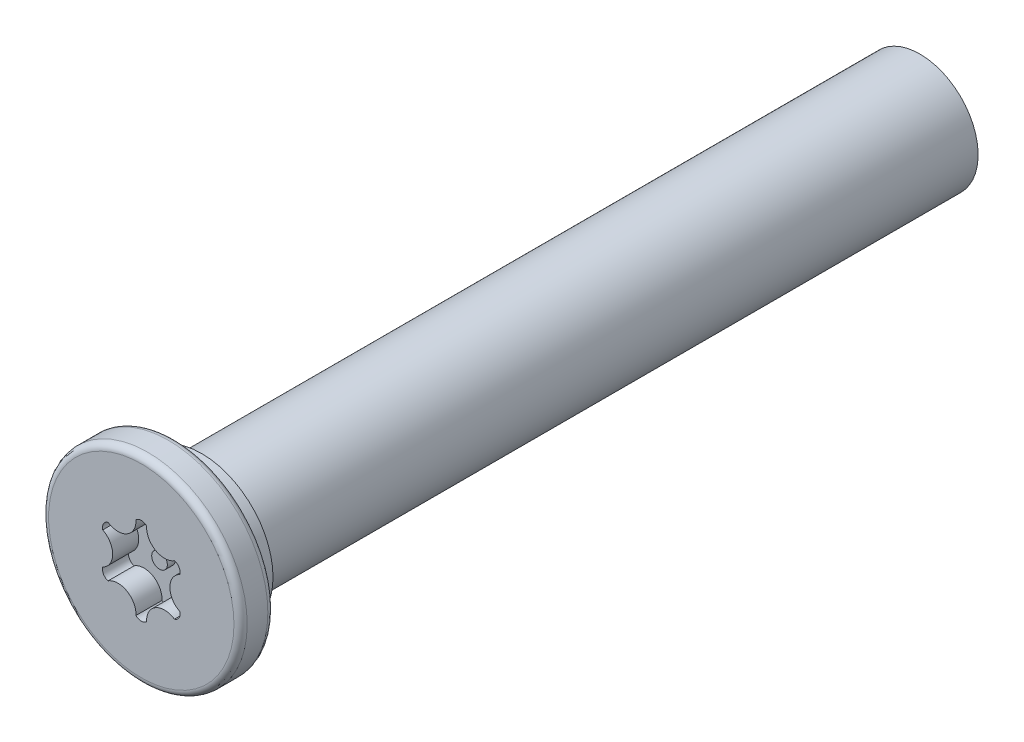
ISO-10303-21;
HEADER;
FILE_DESCRIPTION(('STEP AP214'),'2;1');
FILE_NAME('part.step','',(''),(''),'','','');
FILE_SCHEMA(('AUTOMOTIVE_DESIGN { 1 0 10303 214 1 1 1 1 }'));
ENDSEC;
DATA;
#1=APPLICATION_CONTEXT('core data for automotive mechanical design processes');
#2=APPLICATION_PROTOCOL_DEFINITION('international standard','automotive_design',2000,#1);
#3=PRODUCT_CONTEXT('',#1,'mechanical');
#4=PRODUCT('Part','Part','',(#3));
#5=PRODUCT_RELATED_PRODUCT_CATEGORY('part','',(#4));
#6=PRODUCT_DEFINITION_FORMATION('','',#4);
#7=PRODUCT_DEFINITION_CONTEXT('part definition',#1,'design');
#8=PRODUCT_DEFINITION('design','',#6,#7);
#9=PRODUCT_DEFINITION_SHAPE('','',#8);
#10=(LENGTH_UNIT() NAMED_UNIT(*) SI_UNIT(.MILLI.,.METRE.));
#11=(NAMED_UNIT(*) PLANE_ANGLE_UNIT() SI_UNIT($,.RADIAN.));
#12=(NAMED_UNIT(*) SI_UNIT($,.STERADIAN.) SOLID_ANGLE_UNIT());
#13=UNCERTAINTY_MEASURE_WITH_UNIT(LENGTH_MEASURE(1.E-05),#10,'distance_accuracy_value','');
#14=(GEOMETRIC_REPRESENTATION_CONTEXT(3) GLOBAL_UNCERTAINTY_ASSIGNED_CONTEXT((#13)) GLOBAL_UNIT_ASSIGNED_CONTEXT((#10,
#11,#12)) REPRESENTATION_CONTEXT('',''));
#15=CARTESIAN_POINT('',(0.,0.,0.));
#16=DIRECTION('',(0.,0.,1.));
#17=DIRECTION('',(1.,0.,0.));
#18=AXIS2_PLACEMENT_3D('',#15,#16,#17);
#19=CARTESIAN_POINT('',(0.,0.,0.));
#20=DIRECTION('',(0.,0.,1.));
#21=DIRECTION('',(1.,0.,0.));
#22=AXIS2_PLACEMENT_3D('',#19,#20,#21);
#23=PLANE('',#22);
#24=CARTESIAN_POINT('',(0.,0.,0.));
#25=DIRECTION('',(0.,0.,1.));
#26=DIRECTION('',(1.,0.,0.));
#27=AXIS2_PLACEMENT_3D('',#24,#25,#26);
#28=CIRCLE('',#27,3.55599999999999);
#29=CARTESIAN_POINT('',(3.55599999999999,0.,0.));
#30=VERTEX_POINT('',#29);
#31=EDGE_CURVE('E54',#30,#30,#28,.T.);
#32=ORIENTED_EDGE('',*,*,#31,.T.);
#33=EDGE_LOOP('',(#32));
#34=FACE_BOUND('',#33,.T.);
#35=CARTESIAN_POINT('',(0.893828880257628,1.54815703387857,0.));
#36=DIRECTION('',(0.,0.,1.));
#37=DIRECTION('',(1.,0.,0.));
#38=AXIS2_PLACEMENT_3D('',#35,#36,#37);
#39=CIRCLE('',#38,0.69);
#40=CARTESIAN_POINT('',(0.205060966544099,1.58937306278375,0.));
#41=VERTEX_POINT('',#40);
#42=CARTESIAN_POINT('',(1.27390696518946,0.972274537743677,0.));
#43=VERTEX_POINT('',#42);
#44=EDGE_CURVE('E181',#41,#43,#39,.T.);
#45=ORIENTED_EDGE('',*,*,#44,.T.);
#46=CARTESIAN_POINT('',(1.19884944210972,0.692156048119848,0.));
#47=DIRECTION('',(0.,0.,1.));
#48=DIRECTION('',(1.,0.,0.));
#49=AXIS2_PLACEMENT_3D('',#46,#47,#48);
#50=CIRCLE('',#49,0.29);
#51=CARTESIAN_POINT('',(1.47896793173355,0.617098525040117,0.));
#52=VERTEX_POINT('',#51);
#53=EDGE_CURVE('E61',#43,#52,#50,.F.);
#54=ORIENTED_EDGE('',*,*,#53,.T.);
#55=CARTESIAN_POINT('',(1.78765776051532,0.,0.));
#56=DIRECTION('',(0.,0.,1.));
#57=DIRECTION('',(1.,0.,0.));
#58=AXIS2_PLACEMENT_3D('',#55,#56,#57);
#59=CIRCLE('',#58,0.69);
#60=CARTESIAN_POINT('',(1.47896793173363,-0.617098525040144,0.));
#61=VERTEX_POINT('',#60);
#62=EDGE_CURVE('E111',#52,#61,#59,.T.);
#63=ORIENTED_EDGE('',*,*,#62,.T.);
#64=CARTESIAN_POINT('',(1.1988494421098,-0.692156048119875,0.));
#65=DIRECTION('',(0.,0.,1.));
#66=DIRECTION('',(1.,0.,0.));
#67=AXIS2_PLACEMENT_3D('',#64,#65,#66);
#68=CIRCLE('',#67,0.29);
#69=CARTESIAN_POINT('',(1.27390696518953,-0.972274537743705,0.));
#70=VERTEX_POINT('',#69);
#71=EDGE_CURVE('E216',#61,#70,#68,.F.);
#72=ORIENTED_EDGE('',*,*,#71,.T.);
#73=CARTESIAN_POINT('',(0.893828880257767,-1.54815703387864,0.));
#74=DIRECTION('',(0.,0.,1.));
#75=DIRECTION('',(1.,0.,0.));
#76=AXIS2_PLACEMENT_3D('',#73,#74,#75);
#77=CIRCLE('',#76,0.69);
#78=CARTESIAN_POINT('',(0.205060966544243,-1.5893730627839,0.));
#79=VERTEX_POINT('',#78);
#80=EDGE_CURVE('E160',#70,#79,#77,.T.);
#81=ORIENTED_EDGE('',*,*,#80,.T.);
#82=CARTESIAN_POINT('',(1.43067375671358E-13,-1.3843120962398,0.));
#83=DIRECTION('',(0.,0.,1.));
#84=DIRECTION('',(1.,0.,0.));
#85=AXIS2_PLACEMENT_3D('',#82,#83,#84);
#86=CIRCLE('',#85,0.29);
#87=CARTESIAN_POINT('',(-0.205060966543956,-1.5893730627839,0.));
#88=VERTEX_POINT('',#87);
#89=EDGE_CURVE('E210',#79,#88,#86,.F.);
#90=ORIENTED_EDGE('',*,*,#89,.T.);
#91=CARTESIAN_POINT('',(-0.893828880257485,-1.54815703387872,0.));
#92=DIRECTION('',(0.,0.,1.));
#93=DIRECTION('',(1.,0.,0.));
#94=AXIS2_PLACEMENT_3D('',#91,#92,#93);
#95=CIRCLE('',#94,0.69);
#96=CARTESIAN_POINT('',(-1.27390696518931,-0.97227453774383,0.));
#97=VERTEX_POINT('',#96);
#98=EDGE_CURVE('E206',#88,#97,#95,.T.);
#99=ORIENTED_EDGE('',*,*,#98,.T.);
#100=CARTESIAN_POINT('',(-1.19884944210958,-0.69215604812,0.));
#101=DIRECTION('',(0.,0.,1.));
#102=DIRECTION('',(1.,0.,0.));
#103=AXIS2_PLACEMENT_3D('',#100,#101,#102);
#104=CIRCLE('',#103,0.29);
#105=CARTESIAN_POINT('',(-1.47896793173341,-0.617098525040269,0.));
#106=VERTEX_POINT('',#105);
#107=EDGE_CURVE('E202',#97,#106,#104,.F.);
#108=ORIENTED_EDGE('',*,*,#107,.T.);
#109=CARTESIAN_POINT('',(-1.78765776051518,-1.56674837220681E-13,0.));
#110=DIRECTION('',(0.,0.,1.));
#111=DIRECTION('',(1.,0.,0.));
#112=AXIS2_PLACEMENT_3D('',#109,#110,#111);
#113=CIRCLE('',#112,0.69);
#114=CARTESIAN_POINT('',(-1.47896793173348,0.617098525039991,0.));
#115=VERTEX_POINT('',#114);
#116=EDGE_CURVE('E198',#106,#115,#113,.T.);
#117=ORIENTED_EDGE('',*,*,#116,.T.);
#118=CARTESIAN_POINT('',(-1.19884944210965,0.692156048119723,0.));
#119=DIRECTION('',(0.,0.,1.));
#120=DIRECTION('',(1.,0.,0.));
#121=AXIS2_PLACEMENT_3D('',#118,#119,#120);
#122=CIRCLE('',#121,0.29);
#123=CARTESIAN_POINT('',(-1.27390696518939,0.972274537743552,0.));
#124=VERTEX_POINT('',#123);
#125=EDGE_CURVE('E194',#115,#124,#122,.F.);
#126=ORIENTED_EDGE('',*,*,#125,.T.);
#127=CARTESIAN_POINT('',(-0.893828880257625,1.54815703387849,0.));
#128=DIRECTION('',(0.,0.,1.));
#129=DIRECTION('',(1.,0.,0.));
#130=AXIS2_PLACEMENT_3D('',#127,#128,#129);
#131=CIRCLE('',#130,0.690000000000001);
#132=CARTESIAN_POINT('',(-0.205060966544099,1.58937306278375,0.));
#133=VERTEX_POINT('',#132);
#134=EDGE_CURVE('E190',#124,#133,#131,.T.);
#135=ORIENTED_EDGE('',*,*,#134,.T.);
#136=CARTESIAN_POINT('',(0.,1.38431209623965,0.));
#137=DIRECTION('',(0.,0.,1.));
#138=DIRECTION('',(1.,0.,0.));
#139=AXIS2_PLACEMENT_3D('',#136,#137,#138);
#140=CIRCLE('',#139,0.29);
#141=EDGE_CURVE('E186',#133,#41,#140,.F.);
#142=ORIENTED_EDGE('',*,*,#141,.T.);
#143=EDGE_LOOP('',(#45,#54,#63,#72,#81,#90,#99,#108,#117,#126,#135,#142));
#144=FACE_BOUND('',#143,.T.);
#145=ADVANCED_FACE('F45',(#34,#144),#23,.T.);
#146=CARTESIAN_POINT('',(0.,0.,-1.3));
#147=DIRECTION('',(0.,0.,1.));
#148=DIRECTION('',(1.,0.,0.));
#149=AXIS2_PLACEMENT_3D('',#146,#147,#148);
#150=PLANE('',#149);
#151=CARTESIAN_POINT('',(0.,0.,-1.3));
#152=DIRECTION('',(0.,0.,1.));
#153=DIRECTION('',(1.,0.,0.));
#154=AXIS2_PLACEMENT_3D('',#151,#152,#153);
#155=CIRCLE('',#154,2.738000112);
#156=CARTESIAN_POINT('',(2.738000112,0.,-1.3));
#157=VERTEX_POINT('',#156);
#158=EDGE_CURVE('E11',#157,#157,#155,.F.);
#159=ORIENTED_EDGE('',*,*,#158,.F.);
#160=EDGE_LOOP('',(#159));
#161=FACE_BOUND('',#160,.T.);
#162=CARTESIAN_POINT('',(0.,0.,-1.3));
#163=DIRECTION('',(0.,0.,1.));
#164=DIRECTION('',(1.,0.,0.));
#165=AXIS2_PLACEMENT_3D('',#162,#163,#164);
#166=CIRCLE('',#165,3.55599999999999);
#167=CARTESIAN_POINT('',(3.55599999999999,0.,-1.3));
#168=VERTEX_POINT('',#167);
#169=EDGE_CURVE('E260',#168,#168,#166,.F.);
#170=ORIENTED_EDGE('',*,*,#169,.T.);
#171=EDGE_LOOP('',(#170));
#172=FACE_BOUND('',#171,.T.);
#173=ADVANCED_FACE('F283',(#161,#172),#150,.F.);
#174=CARTESIAN_POINT('',(0.,0.,-1.3));
#175=DIRECTION('',(0.,0.,1.));
#176=DIRECTION('',(1.,0.,0.));
#177=AXIS2_PLACEMENT_3D('',#174,#175,#176);
#178=CYLINDRICAL_SURFACE('',#177,3.80999999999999);
#179=CARTESIAN_POINT('',(0.,0.,-1.046));
#180=DIRECTION('',(0.,0.,1.));
#181=DIRECTION('',(1.,0.,0.));
#182=AXIS2_PLACEMENT_3D('',#179,#180,#181);
#183=CIRCLE('',#182,3.80999999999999);
#184=CARTESIAN_POINT('',(3.80999999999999,0.,-1.046));
#185=VERTEX_POINT('',#184);
#186=EDGE_CURVE('E256',#185,#185,#183,.T.);
#187=ORIENTED_EDGE('',*,*,#186,.T.);
#188=EDGE_LOOP('',(#187));
#189=FACE_BOUND('',#188,.T.);
#190=CARTESIAN_POINT('',(0.,0.,-0.254));
#191=DIRECTION('',(0.,0.,1.));
#192=DIRECTION('',(1.,0.,0.));
#193=AXIS2_PLACEMENT_3D('',#190,#191,#192);
#194=CIRCLE('',#193,3.80999999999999);
#195=CARTESIAN_POINT('',(3.80999999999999,0.,-0.254));
#196=VERTEX_POINT('',#195);
#197=EDGE_CURVE('E225',#196,#196,#194,.F.);
#198=ORIENTED_EDGE('',*,*,#197,.T.);
#199=EDGE_LOOP('',(#198));
#200=FACE_BOUND('',#199,.T.);
#201=ADVANCED_FACE('F289',(#189,#200),#178,.T.);
#202=CARTESIAN_POINT('',(1.19884944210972,0.692156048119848,-1.));
#203=DIRECTION('',(0.,0.,1.));
#204=DIRECTION('',(1.,0.,0.));
#205=AXIS2_PLACEMENT_3D('',#202,#203,#204);
#206=CYLINDRICAL_SURFACE('',#205,0.29);
#207=ORIENTED_EDGE('',*,*,#53,.F.);
#208=DIRECTION('',(0.,0.,1.));
#209=VECTOR('',#208,1.);
#210=CARTESIAN_POINT('',(1.27390696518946,0.972274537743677,-1.));
#211=LINE('',#210,#209);
#212=CARTESIAN_POINT('',(1.27390696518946,0.972274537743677,-1.));
#213=VERTEX_POINT('',#212);
#214=EDGE_CURVE('E178',#213,#43,#211,.T.);
#215=ORIENTED_EDGE('',*,*,#214,.F.);
#216=CARTESIAN_POINT('',(1.19884944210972,0.692156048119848,-1.));
#217=DIRECTION('',(0.,0.,1.));
#218=DIRECTION('',(1.,0.,0.));
#219=AXIS2_PLACEMENT_3D('',#216,#217,#218);
#220=CIRCLE('',#219,0.29);
#221=CARTESIAN_POINT('',(1.47896793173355,0.617098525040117,-1.));
#222=VERTEX_POINT('',#221);
#223=EDGE_CURVE('E221',#213,#222,#220,.F.);
#224=ORIENTED_EDGE('',*,*,#223,.T.);
#225=DIRECTION('',(0.,0.,1.));
#226=VECTOR('',#225,1.);
#227=CARTESIAN_POINT('',(1.47896793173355,0.617098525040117,-1.));
#228=LINE('',#227,#226);
#229=EDGE_CURVE('E222',#222,#52,#228,.T.);
#230=ORIENTED_EDGE('',*,*,#229,.T.);
#231=EDGE_LOOP('',(#207,#215,#224,#230));
#232=FACE_BOUND('',#231,.T.);
#233=ADVANCED_FACE('F294',(#232),#206,.F.);
#234=CARTESIAN_POINT('',(1.78765776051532,0.,-1.));
#235=DIRECTION('',(0.,0.,1.));
#236=DIRECTION('',(1.,0.,0.));
#237=AXIS2_PLACEMENT_3D('',#234,#235,#236);
#238=CYLINDRICAL_SURFACE('',#237,0.69);
#239=ORIENTED_EDGE('',*,*,#62,.F.);
#240=ORIENTED_EDGE('',*,*,#229,.F.);
#241=CARTESIAN_POINT('',(1.78765776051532,0.,-1.));
#242=DIRECTION('',(0.,0.,1.));
#243=DIRECTION('',(1.,0.,0.));
#244=AXIS2_PLACEMENT_3D('',#241,#242,#243);
#245=CIRCLE('',#244,0.69);
#246=CARTESIAN_POINT('',(1.47896793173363,-0.617098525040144,-1.));
#247=VERTEX_POINT('',#246);
#248=EDGE_CURVE('E70',#222,#247,#245,.T.);
#249=ORIENTED_EDGE('',*,*,#248,.T.);
#250=DIRECTION('',(0.,0.,1.));
#251=VECTOR('',#250,1.);
#252=CARTESIAN_POINT('',(1.47896793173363,-0.617098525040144,-1.));
#253=LINE('',#252,#251);
#254=EDGE_CURVE('E151',#247,#61,#253,.T.);
#255=ORIENTED_EDGE('',*,*,#254,.T.);
#256=EDGE_LOOP('',(#239,#240,#249,#255));
#257=FACE_BOUND('',#256,.T.);
#258=ADVANCED_FACE('F301',(#257),#238,.T.);
#259=CARTESIAN_POINT('',(1.1988494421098,-0.692156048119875,-1.));
#260=DIRECTION('',(0.,0.,1.));
#261=DIRECTION('',(1.,0.,0.));
#262=AXIS2_PLACEMENT_3D('',#259,#260,#261);
#263=CYLINDRICAL_SURFACE('',#262,0.29);
#264=ORIENTED_EDGE('',*,*,#71,.F.);
#265=ORIENTED_EDGE('',*,*,#254,.F.);
#266=CARTESIAN_POINT('',(1.1988494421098,-0.692156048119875,-1.));
#267=DIRECTION('',(0.,0.,1.));
#268=DIRECTION('',(1.,0.,0.));
#269=AXIS2_PLACEMENT_3D('',#266,#267,#268);
#270=CIRCLE('',#269,0.29);
#271=CARTESIAN_POINT('',(1.27390696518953,-0.972274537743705,-1.));
#272=VERTEX_POINT('',#271);
#273=EDGE_CURVE('E145',#247,#272,#270,.F.);
#274=ORIENTED_EDGE('',*,*,#273,.T.);
#275=DIRECTION('',(0.,0.,1.));
#276=VECTOR('',#275,1.);
#277=CARTESIAN_POINT('',(1.27390696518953,-0.972274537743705,-1.));
#278=LINE('',#277,#276);
#279=EDGE_CURVE('E149',#272,#70,#278,.T.);
#280=ORIENTED_EDGE('',*,*,#279,.T.);
#281=EDGE_LOOP('',(#264,#265,#274,#280));
#282=FACE_BOUND('',#281,.T.);
#283=ADVANCED_FACE('F148',(#282),#263,.F.);
#284=CARTESIAN_POINT('',(0.893828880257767,-1.54815703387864,-1.));
#285=DIRECTION('',(0.,0.,1.));
#286=DIRECTION('',(1.,0.,0.));
#287=AXIS2_PLACEMENT_3D('',#284,#285,#286);
#288=CYLINDRICAL_SURFACE('',#287,0.69);
#289=ORIENTED_EDGE('',*,*,#80,.F.);
#290=ORIENTED_EDGE('',*,*,#279,.F.);
#291=CARTESIAN_POINT('',(0.893828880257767,-1.54815703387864,-1.));
#292=DIRECTION('',(0.,0.,1.));
#293=DIRECTION('',(1.,0.,0.));
#294=AXIS2_PLACEMENT_3D('',#291,#292,#293);
#295=CIRCLE('',#294,0.69);
#296=CARTESIAN_POINT('',(0.205060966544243,-1.5893730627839,-1.));
#297=VERTEX_POINT('',#296);
#298=EDGE_CURVE('E154',#272,#297,#295,.T.);
#299=ORIENTED_EDGE('',*,*,#298,.T.);
#300=DIRECTION('',(0.,0.,1.));
#301=VECTOR('',#300,1.);
#302=CARTESIAN_POINT('',(0.205060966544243,-1.5893730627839,-1.));
#303=LINE('',#302,#301);
#304=EDGE_CURVE('E163',#297,#79,#303,.T.);
#305=ORIENTED_EDGE('',*,*,#304,.T.);
#306=EDGE_LOOP('',(#289,#290,#299,#305));
#307=FACE_BOUND('',#306,.T.);
#308=ADVANCED_FACE('F157',(#307),#288,.T.);
#309=CARTESIAN_POINT('',(1.43067375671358E-13,-1.3843120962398,-1.));
#310=DIRECTION('',(0.,0.,1.));
#311=DIRECTION('',(1.,0.,0.));
#312=AXIS2_PLACEMENT_3D('',#309,#310,#311);
#313=CYLINDRICAL_SURFACE('',#312,0.29);
#314=ORIENTED_EDGE('',*,*,#89,.F.);
#315=ORIENTED_EDGE('',*,*,#304,.F.);
#316=CARTESIAN_POINT('',(1.43067375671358E-13,-1.3843120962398,-1.));
#317=DIRECTION('',(0.,0.,1.));
#318=DIRECTION('',(1.,0.,0.));
#319=AXIS2_PLACEMENT_3D('',#316,#317,#318);
#320=CIRCLE('',#319,0.29);
#321=CARTESIAN_POINT('',(-0.205060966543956,-1.5893730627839,-1.));
#322=VERTEX_POINT('',#321);
#323=EDGE_CURVE('E168',#297,#322,#320,.F.);
#324=ORIENTED_EDGE('',*,*,#323,.T.);
#325=DIRECTION('',(0.,0.,1.));
#326=VECTOR('',#325,1.);
#327=CARTESIAN_POINT('',(-0.205060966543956,-1.5893730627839,-1.));
#328=LINE('',#327,#326);
#329=EDGE_CURVE('E230',#322,#88,#328,.T.);
#330=ORIENTED_EDGE('',*,*,#329,.T.);
#331=EDGE_LOOP('',(#314,#315,#324,#330));
#332=FACE_BOUND('',#331,.T.);
#333=ADVANCED_FACE('F318',(#332),#313,.F.);
#334=CARTESIAN_POINT('',(-0.893828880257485,-1.54815703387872,-1.));
#335=DIRECTION('',(0.,0.,1.));
#336=DIRECTION('',(1.,0.,0.));
#337=AXIS2_PLACEMENT_3D('',#334,#335,#336);
#338=CYLINDRICAL_SURFACE('',#337,0.69);
#339=ORIENTED_EDGE('',*,*,#98,.F.);
#340=ORIENTED_EDGE('',*,*,#329,.F.);
#341=CARTESIAN_POINT('',(-0.893828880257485,-1.54815703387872,-1.));
#342=DIRECTION('',(0.,0.,1.));
#343=DIRECTION('',(1.,0.,0.));
#344=AXIS2_PLACEMENT_3D('',#341,#342,#343);
#345=CIRCLE('',#344,0.69);
#346=CARTESIAN_POINT('',(-1.27390696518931,-0.97227453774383,-1.));
#347=VERTEX_POINT('',#346);
#348=EDGE_CURVE('E172',#322,#347,#345,.T.);
#349=ORIENTED_EDGE('',*,*,#348,.T.);
#350=DIRECTION('',(0.,0.,1.));
#351=VECTOR('',#350,1.);
#352=CARTESIAN_POINT('',(-1.27390696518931,-0.97227453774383,-1.));
#353=LINE('',#352,#351);
#354=EDGE_CURVE('E233',#347,#97,#353,.T.);
#355=ORIENTED_EDGE('',*,*,#354,.T.);
#356=EDGE_LOOP('',(#339,#340,#349,#355));
#357=FACE_BOUND('',#356,.T.);
#358=ADVANCED_FACE('F321',(#357),#338,.T.);
#359=CARTESIAN_POINT('',(-1.19884944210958,-0.69215604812,-1.));
#360=DIRECTION('',(0.,0.,1.));
#361=DIRECTION('',(1.,0.,0.));
#362=AXIS2_PLACEMENT_3D('',#359,#360,#361);
#363=CYLINDRICAL_SURFACE('',#362,0.29);
#364=ORIENTED_EDGE('',*,*,#107,.F.);
#365=ORIENTED_EDGE('',*,*,#354,.F.);
#366=CARTESIAN_POINT('',(-1.19884944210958,-0.69215604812,-1.));
#367=DIRECTION('',(0.,0.,1.));
#368=DIRECTION('',(1.,0.,0.));
#369=AXIS2_PLACEMENT_3D('',#366,#367,#368);
#370=CIRCLE('',#369,0.29);
#371=CARTESIAN_POINT('',(-1.47896793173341,-0.617098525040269,-1.));
#372=VERTEX_POINT('',#371);
#373=EDGE_CURVE('E374',#347,#372,#370,.F.);
#374=ORIENTED_EDGE('',*,*,#373,.T.);
#375=DIRECTION('',(0.,0.,1.));
#376=VECTOR('',#375,1.);
#377=CARTESIAN_POINT('',(-1.47896793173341,-0.617098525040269,-1.));
#378=LINE('',#377,#376);
#379=EDGE_CURVE('E236',#372,#106,#378,.T.);
#380=ORIENTED_EDGE('',*,*,#379,.T.);
#381=EDGE_LOOP('',(#364,#365,#374,#380));
#382=FACE_BOUND('',#381,.T.);
#383=ADVANCED_FACE('F325',(#382),#363,.F.);
#384=CARTESIAN_POINT('',(-1.78765776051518,-1.56674837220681E-13,-1.));
#385=DIRECTION('',(0.,0.,1.));
#386=DIRECTION('',(1.,0.,0.));
#387=AXIS2_PLACEMENT_3D('',#384,#385,#386);
#388=CYLINDRICAL_SURFACE('',#387,0.69);
#389=ORIENTED_EDGE('',*,*,#116,.F.);
#390=ORIENTED_EDGE('',*,*,#379,.F.);
#391=CARTESIAN_POINT('',(-1.78765776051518,-1.56674837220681E-13,-1.));
#392=DIRECTION('',(0.,0.,1.));
#393=DIRECTION('',(1.,0.,0.));
#394=AXIS2_PLACEMENT_3D('',#391,#392,#393);
#395=CIRCLE('',#394,0.69);
#396=CARTESIAN_POINT('',(-1.47896793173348,0.617098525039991,-1.));
#397=VERTEX_POINT('',#396);
#398=EDGE_CURVE('E371',#372,#397,#395,.T.);
#399=ORIENTED_EDGE('',*,*,#398,.T.);
#400=DIRECTION('',(0.,0.,1.));
#401=VECTOR('',#400,1.);
#402=CARTESIAN_POINT('',(-1.47896793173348,0.617098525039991,-1.));
#403=LINE('',#402,#401);
#404=EDGE_CURVE('E239',#397,#115,#403,.T.);
#405=ORIENTED_EDGE('',*,*,#404,.T.);
#406=EDGE_LOOP('',(#389,#390,#399,#405));
#407=FACE_BOUND('',#406,.T.);
#408=ADVANCED_FACE('F329',(#407),#388,.T.);
#409=CARTESIAN_POINT('',(-1.19884944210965,0.692156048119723,-1.));
#410=DIRECTION('',(0.,0.,1.));
#411=DIRECTION('',(1.,0.,0.));
#412=AXIS2_PLACEMENT_3D('',#409,#410,#411);
#413=CYLINDRICAL_SURFACE('',#412,0.29);
#414=ORIENTED_EDGE('',*,*,#125,.F.);
#415=ORIENTED_EDGE('',*,*,#404,.F.);
#416=CARTESIAN_POINT('',(-1.19884944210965,0.692156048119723,-1.));
#417=DIRECTION('',(0.,0.,1.));
#418=DIRECTION('',(1.,0.,0.));
#419=AXIS2_PLACEMENT_3D('',#416,#417,#418);
#420=CIRCLE('',#419,0.29);
#421=CARTESIAN_POINT('',(-1.27390696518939,0.972274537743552,-1.));
#422=VERTEX_POINT('',#421);
#423=EDGE_CURVE('E364',#397,#422,#420,.F.);
#424=ORIENTED_EDGE('',*,*,#423,.T.);
#425=DIRECTION('',(0.,0.,1.));
#426=VECTOR('',#425,1.);
#427=CARTESIAN_POINT('',(-1.27390696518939,0.972274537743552,-1.));
#428=LINE('',#427,#426);
#429=EDGE_CURVE('E242',#422,#124,#428,.T.);
#430=ORIENTED_EDGE('',*,*,#429,.T.);
#431=EDGE_LOOP('',(#414,#415,#424,#430));
#432=FACE_BOUND('',#431,.T.);
#433=ADVANCED_FACE('F333',(#432),#413,.F.);
#434=CARTESIAN_POINT('',(-0.893828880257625,1.54815703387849,-1.));
#435=DIRECTION('',(0.,0.,1.));
#436=DIRECTION('',(1.,0.,0.));
#437=AXIS2_PLACEMENT_3D('',#434,#435,#436);
#438=CYLINDRICAL_SURFACE('',#437,0.690000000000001);
#439=ORIENTED_EDGE('',*,*,#134,.F.);
#440=ORIENTED_EDGE('',*,*,#429,.F.);
#441=CARTESIAN_POINT('',(-0.893828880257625,1.54815703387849,-1.));
#442=DIRECTION('',(0.,0.,1.));
#443=DIRECTION('',(1.,0.,0.));
#444=AXIS2_PLACEMENT_3D('',#441,#442,#443);
#445=CIRCLE('',#444,0.690000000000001);
#446=CARTESIAN_POINT('',(-0.205060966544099,1.58937306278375,-1.));
#447=VERTEX_POINT('',#446);
#448=EDGE_CURVE('E360',#422,#447,#445,.T.);
#449=ORIENTED_EDGE('',*,*,#448,.T.);
#450=DIRECTION('',(0.,0.,1.));
#451=VECTOR('',#450,1.);
#452=CARTESIAN_POINT('',(-0.205060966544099,1.58937306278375,-1.));
#453=LINE('',#452,#451);
#454=EDGE_CURVE('E245',#447,#133,#453,.T.);
#455=ORIENTED_EDGE('',*,*,#454,.T.);
#456=EDGE_LOOP('',(#439,#440,#449,#455));
#457=FACE_BOUND('',#456,.T.);
#458=ADVANCED_FACE('F337',(#457),#438,.T.);
#459=CARTESIAN_POINT('',(0.,1.38431209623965,-1.));
#460=DIRECTION('',(0.,0.,1.));
#461=DIRECTION('',(1.,0.,0.));
#462=AXIS2_PLACEMENT_3D('',#459,#460,#461);
#463=CYLINDRICAL_SURFACE('',#462,0.29);
#464=ORIENTED_EDGE('',*,*,#141,.F.);
#465=ORIENTED_EDGE('',*,*,#454,.F.);
#466=CARTESIAN_POINT('',(0.,1.38431209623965,-1.));
#467=DIRECTION('',(0.,0.,1.));
#468=DIRECTION('',(1.,0.,0.));
#469=AXIS2_PLACEMENT_3D('',#466,#467,#468);
#470=CIRCLE('',#469,0.29);
#471=CARTESIAN_POINT('',(0.205060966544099,1.58937306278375,-1.));
#472=VERTEX_POINT('',#471);
#473=EDGE_CURVE('E357',#447,#472,#470,.F.);
#474=ORIENTED_EDGE('',*,*,#473,.T.);
#475=DIRECTION('',(0.,0.,1.));
#476=VECTOR('',#475,1.);
#477=CARTESIAN_POINT('',(0.205060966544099,1.58937306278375,-1.));
#478=LINE('',#477,#476);
#479=EDGE_CURVE('E248',#472,#41,#478,.T.);
#480=ORIENTED_EDGE('',*,*,#479,.T.);
#481=EDGE_LOOP('',(#464,#465,#474,#480));
#482=FACE_BOUND('',#481,.T.);
#483=ADVANCED_FACE('F341',(#482),#463,.F.);
#484=CARTESIAN_POINT('',(0.893828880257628,1.54815703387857,-1.));
#485=DIRECTION('',(0.,0.,1.));
#486=DIRECTION('',(1.,0.,0.));
#487=AXIS2_PLACEMENT_3D('',#484,#485,#486);
#488=CYLINDRICAL_SURFACE('',#487,0.69);
#489=ORIENTED_EDGE('',*,*,#44,.F.);
#490=ORIENTED_EDGE('',*,*,#479,.F.);
#491=CARTESIAN_POINT('',(0.893828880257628,1.54815703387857,-1.));
#492=DIRECTION('',(0.,0.,1.));
#493=DIRECTION('',(1.,0.,0.));
#494=AXIS2_PLACEMENT_3D('',#491,#492,#493);
#495=CIRCLE('',#494,0.69);
#496=EDGE_CURVE('E118',#472,#213,#495,.T.);
#497=ORIENTED_EDGE('',*,*,#496,.T.);
#498=ORIENTED_EDGE('',*,*,#214,.T.);
#499=EDGE_LOOP('',(#489,#490,#497,#498));
#500=FACE_BOUND('',#499,.T.);
#501=ADVANCED_FACE('F344',(#500),#488,.T.);
#502=CARTESIAN_POINT('',(0.,0.,-1.));
#503=DIRECTION('',(0.,0.,1.));
#504=DIRECTION('',(1.,0.,0.));
#505=AXIS2_PLACEMENT_3D('',#502,#503,#504);
#506=PLANE('',#505);
#507=CARTESIAN_POINT('',(0.,0.,-1.));
#508=DIRECTION('',(0.,0.,1.));
#509=DIRECTION('',(1.,0.,0.));
#510=AXIS2_PLACEMENT_3D('',#507,#508,#509);
#511=CIRCLE('',#510,0.3);
#512=CARTESIAN_POINT('',(0.3,0.,-1.));
#513=VERTEX_POINT('',#512);
#514=EDGE_CURVE('E396',#513,#513,#511,.T.);
#515=ORIENTED_EDGE('',*,*,#514,.F.);
#516=EDGE_LOOP('',(#515));
#517=FACE_BOUND('',#516,.T.);
#518=ORIENTED_EDGE('',*,*,#223,.F.);
#519=ORIENTED_EDGE('',*,*,#496,.F.);
#520=ORIENTED_EDGE('',*,*,#473,.F.);
#521=ORIENTED_EDGE('',*,*,#448,.F.);
#522=ORIENTED_EDGE('',*,*,#423,.F.);
#523=ORIENTED_EDGE('',*,*,#398,.F.);
#524=ORIENTED_EDGE('',*,*,#373,.F.);
#525=ORIENTED_EDGE('',*,*,#348,.F.);
#526=ORIENTED_EDGE('',*,*,#323,.F.);
#527=ORIENTED_EDGE('',*,*,#298,.F.);
#528=ORIENTED_EDGE('',*,*,#273,.F.);
#529=ORIENTED_EDGE('',*,*,#248,.F.);
#530=EDGE_LOOP('',(#518,#519,#520,#521,#522,#523,#524,#525,#526,#527,#528,#529));
#531=FACE_BOUND('',#530,.T.);
#532=ADVANCED_FACE('F166',(#517,#531),#506,.T.);
#533=CARTESIAN_POINT('',(0.,0.,-1.046));
#534=DIRECTION('',(0.,0.,1.));
#535=DIRECTION('',(1.,0.,0.));
#536=AXIS2_PLACEMENT_3D('',#533,#534,#535);
#537=TOROIDAL_SURFACE('',#536,3.55599999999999,0.254);
#538=ORIENTED_EDGE('',*,*,#169,.F.);
#539=EDGE_LOOP('',(#538));
#540=FACE_BOUND('',#539,.T.);
#541=ORIENTED_EDGE('',*,*,#186,.F.);
#542=EDGE_LOOP('',(#541));
#543=FACE_BOUND('',#542,.T.);
#544=ADVANCED_FACE('F271',(#540,#543),#537,.T.);
#545=CARTESIAN_POINT('',(0.,0.,-0.254));
#546=DIRECTION('',(0.,0.,1.));
#547=DIRECTION('',(1.,0.,0.));
#548=AXIS2_PLACEMENT_3D('',#545,#546,#547);
#549=TOROIDAL_SURFACE('',#548,3.55599999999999,0.254);
#550=ORIENTED_EDGE('',*,*,#197,.F.);
#551=EDGE_LOOP('',(#550));
#552=FACE_BOUND('',#551,.T.);
#553=ORIENTED_EDGE('',*,*,#31,.F.);
#554=EDGE_LOOP('',(#553));
#555=FACE_BOUND('',#554,.T.);
#556=ADVANCED_FACE('F47',(#552,#555),#549,.T.);
#557=CARTESIAN_POINT('',(0.,0.,-2.316));
#558=DIRECTION('',(0.,0.,-1.));
#559=DIRECTION('',(-1.,0.,0.));
#560=AXIS2_PLACEMENT_3D('',#557,#558,#559);
#561=PLANE('',#560);
#562=CARTESIAN_POINT('',(0.,0.,-2.316));
#563=DIRECTION('',(0.,0.,-1.));
#564=DIRECTION('',(-1.,0.,0.));
#565=AXIS2_PLACEMENT_3D('',#562,#563,#564);
#566=CIRCLE('',#565,2.738000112);
#567=CARTESIAN_POINT('',(-2.738000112,0.,-2.316));
#568=VERTEX_POINT('',#567);
#569=EDGE_CURVE('E182',#568,#568,#566,.T.);
#570=ORIENTED_EDGE('',*,*,#569,.T.);
#571=EDGE_LOOP('',(#570));
#572=FACE_BOUND('',#571,.T.);
#573=CARTESIAN_POINT('',(0.,0.,-2.316));
#574=DIRECTION('',(0.,0.,-1.));
#575=DIRECTION('',(-1.,0.,0.));
#576=AXIS2_PLACEMENT_3D('',#573,#574,#575);
#577=CIRCLE('',#576,2.230000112);
#578=CARTESIAN_POINT('',(-2.230000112,0.,-2.316));
#579=VERTEX_POINT('',#578);
#580=EDGE_CURVE('E400',#579,#579,#577,.T.);
#581=ORIENTED_EDGE('',*,*,#580,.F.);
#582=EDGE_LOOP('',(#581));
#583=FACE_BOUND('',#582,.T.);
#584=ADVANCED_FACE('F270',(#572,#583),#561,.T.);
#585=CARTESIAN_POINT('',(0.,0.,-2.316));
#586=DIRECTION('',(0.,0.,1.));
#587=DIRECTION('',(1.,0.,0.));
#588=AXIS2_PLACEMENT_3D('',#585,#586,#587);
#589=CYLINDRICAL_SURFACE('',#588,2.738000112);
#590=ORIENTED_EDGE('',*,*,#569,.F.);
#591=EDGE_LOOP('',(#590));
#592=FACE_BOUND('',#591,.T.);
#593=ORIENTED_EDGE('',*,*,#158,.T.);
#594=EDGE_LOOP('',(#593));
#595=FACE_BOUND('',#594,.T.);
#596=ADVANCED_FACE('F277',(#592,#595),#589,.T.);
#597=CARTESIAN_POINT('',(0.,0.,-0.7));
#598=DIRECTION('',(0.,0.,-1.));
#599=DIRECTION('',(-1.,0.,0.));
#600=AXIS2_PLACEMENT_3D('',#597,#598,#599);
#601=CYLINDRICAL_SURFACE('',#600,0.3);
#602=CARTESIAN_POINT('',(0.,0.,-0.7));
#603=DIRECTION('',(0.,0.,1.));
#604=DIRECTION('',(1.,0.,0.));
#605=AXIS2_PLACEMENT_3D('',#602,#603,#604);
#606=CIRCLE('',#605,0.3);
#607=CARTESIAN_POINT('',(0.3,0.,-0.7));
#608=VERTEX_POINT('',#607);
#609=EDGE_CURVE('E395',#608,#608,#606,.T.);
#610=ORIENTED_EDGE('',*,*,#609,.F.);
#611=EDGE_LOOP('',(#610));
#612=FACE_BOUND('',#611,.T.);
#613=ORIENTED_EDGE('',*,*,#514,.T.);
#614=EDGE_LOOP('',(#613));
#615=FACE_BOUND('',#614,.T.);
#616=ADVANCED_FACE('F424',(#612,#615),#601,.T.);
#617=CARTESIAN_POINT('',(0.,0.,-0.7));
#618=DIRECTION('',(0.,0.,1.));
#619=DIRECTION('',(1.,0.,0.));
#620=AXIS2_PLACEMENT_3D('',#617,#618,#619);
#621=PLANE('',#620);
#622=ORIENTED_EDGE('',*,*,#609,.T.);
#623=EDGE_LOOP('',(#622));
#624=FACE_BOUND('',#623,.T.);
#625=ADVANCED_FACE('F416',(#624),#621,.T.);
#626=CARTESIAN_POINT('',(0.,0.,-29.875));
#627=DIRECTION('',(0.,0.,1.));
#628=DIRECTION('',(1.,0.,0.));
#629=AXIS2_PLACEMENT_3D('',#626,#627,#628);
#630=CYLINDRICAL_SURFACE('',#629,2.230000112);
#631=ORIENTED_EDGE('',*,*,#580,.T.);
#632=EDGE_LOOP('',(#631));
#633=FACE_BOUND('',#632,.T.);
#634=CARTESIAN_POINT('',(0.,0.,-29.875));
#635=DIRECTION('',(0.,0.,-1.));
#636=DIRECTION('',(-1.,0.,0.));
#637=AXIS2_PLACEMENT_3D('',#634,#635,#636);
#638=CIRCLE('',#637,2.230000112);
#639=CARTESIAN_POINT('',(-2.230000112,0.,-29.875));
#640=VERTEX_POINT('',#639);
#641=EDGE_CURVE('E407',#640,#640,#638,.T.);
#642=ORIENTED_EDGE('',*,*,#641,.F.);
#643=EDGE_LOOP('',(#642));
#644=FACE_BOUND('',#643,.T.);
#645=ADVANCED_FACE('F414',(#633,#644),#630,.T.);
#646=CARTESIAN_POINT('',(0.,0.,-29.875));
#647=DIRECTION('',(0.,0.,-1.));
#648=DIRECTION('',(-1.,0.,0.));
#649=AXIS2_PLACEMENT_3D('',#646,#647,#648);
#650=PLANE('',#649);
#651=ORIENTED_EDGE('',*,*,#641,.T.);
#652=EDGE_LOOP('',(#651));
#653=FACE_BOUND('',#652,.T.);
#654=ADVANCED_FACE('F412',(#653),#650,.T.);
#655=CLOSED_SHELL('',(#145,#173,#201,#233,#258,#283,#308,#333,#358,#383,#408,#433,#458,#483,
#501,#532,#544,#556,#584,#596,#616,#625,#645,#654));
#656=MANIFOLD_SOLID_BREP('B2',#655);
#657=ADVANCED_BREP_SHAPE_REPRESENTATION('',(#18,#656),#14);
#658=SHAPE_DEFINITION_REPRESENTATION(#9,#657);
ENDSEC;
END-ISO-10303-21;
